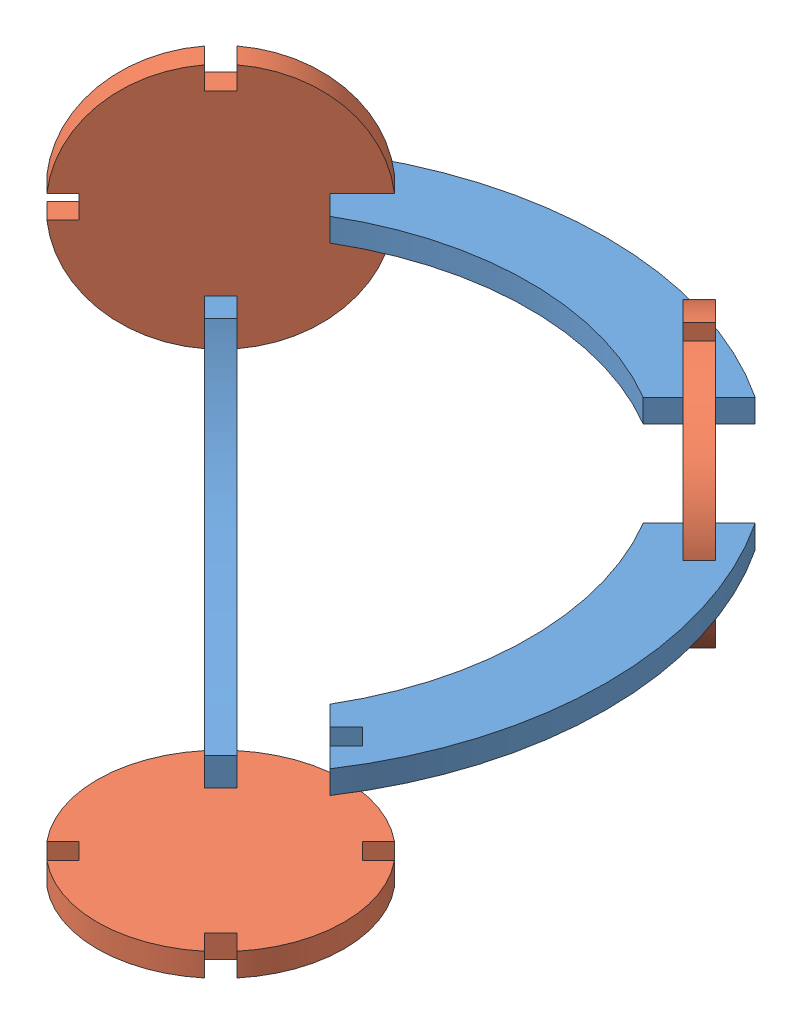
SolidWorks assembly Ensamblaje1.SLDASM, configuration Predeterminado (file format 6000). Lengths in mm.
Overall size (93.34 70.78 77.57).
6 component instances, 2 part files, 12 mates.
Components (placement in the parent):
- arc-1: arc.SLDPRT [Predeterminado] at (-11.2299 0.2072 49.4975) size (55.14 3 15.54)
- join-1: join.SLDPRT [Predeterminado] at (18.723 1.7072 19.5446) x (0.707107 0 0.707107) z (0 1 0) size (31.86 3 31.86)
- arc-2: arc.SLDPRT [Predeterminado] at (-11.2299 3.2072 49.4975) x (0 0 -1) z (-1 0 0) size (55.14 3 15.54)
- join-3: join.SLDPRT [Predeterminado] at (-43.3041 1.7072 17.4232) x (0 -1 0) z (-0.707107 0 0.707107) size (31.86 3 31.86)
- arc-4: arc.SLDPRT [Predeterminado] at (-10.1693 1.7072 48.4368) x (-0.5 0.707107 -0.5) z (0.5 0.707107 0.5) size (55.14 3 15.54)
- join-4: join.SLDPRT [Predeterminado] at (-11.2299 -40.6526 49.4975) x (0.707107 0 0.707107) z (0.707107 0 -0.707107) size (31.86 3 31.86)
Mates (geometry in assembly coordinates):
- Coincidente1: coincident anti-aligned: plane of arc-1 through (13.7733 0.2072 10.3522) normal (-0.707107 0 0.707107); plane of join-1 through (20.8443 1.7072 17.4232) normal (0.707107 0 -0.707107)
- Coincidente2: coincident anti-aligned: plane of arc-1 through (-11.2299 3.2072 49.4975) normal (0 1 0); plane of join-1 through (5.288 3.2072 6.1095) normal (0 -1 0)
- Coincidente3: coincident anti-aligned: plane of arc-1 through (11.6519 0.2072 8.2309) normal (0.707107 0 0.707107); plane of join-1 through (9.5306 0.2072 10.3522) normal (-0.707107 0 -0.707107)
- Coincidente8: coincident anti-aligned: plane of arc-1 through (-34.1118 0.2072 12.4735) normal (-0.707107 0 -0.707107); plane of join-3 through (-41.1828 1.7072 19.5446) normal (0.707107 0 0.707107)
- Coincidente9: coincident anti-aligned: plane of arc-1 through (-11.2299 3.2072 49.4975) normal (0 1 0); plane of join-3 through (-29.8691 3.2072 3.9882) normal (0 -1 0)
- Coincidente10: coincident anti-aligned: plane of arc-1 through (-34.1118 0.2072 8.2309) normal (-0.707107 0 0.707107); plane of join-3 through (-34.1118 0.2072 8.2309) normal (0.707107 0 -0.707107)
- Coincidente11: coincident anti-aligned: plane of join-3 through (-44.3648 -17.2928 18.4839) normal (0.707107 0 -0.707107); plane of arc-4 through (-12.2906 1.7072 50.5581) normal (-0.707107 0 0.707107)
- Coincidente12: coincident anti-aligned: plane of join-3 through (-43.3041 1.7072 17.4232) normal (-0.707107 0 -0.707107); plane of arc-4 through (-42.2435 -8.2928 16.3626) normal (0.707107 0 0.707107)
- Coincidente13: coincident anti-aligned: plane of join-3 through (-44.3648 -11.2928 18.4839) normal (0 -1 0); plane of arc-4 through (-42.2435 -11.2928 16.3626) normal (0 1 0)
- Coincidente14: coincident anti-aligned: plane of arc-4 through (-17.2403 -43.6526 41.3657) normal (0 1 0); plane of join-4 through (-11.2299 -43.6526 49.4975) normal (0 -1 0)
- Coincidente15: coincident anti-aligned: plane of arc-4 through (-12.2906 1.7072 50.5581) normal (-0.707107 0 0.707107); plane of join-4 through (-25.7256 -40.6526 37.1231) normal (0.707107 0 -0.707107)
- Coincidente16: coincident anti-aligned: plane of arc-4 through (-19.3616 -43.6526 39.2444) normal (0.707107 0 0.707107); plane of join-4 through (-21.483 -40.6526 41.3657) normal (-0.707107 0 -0.707107)
